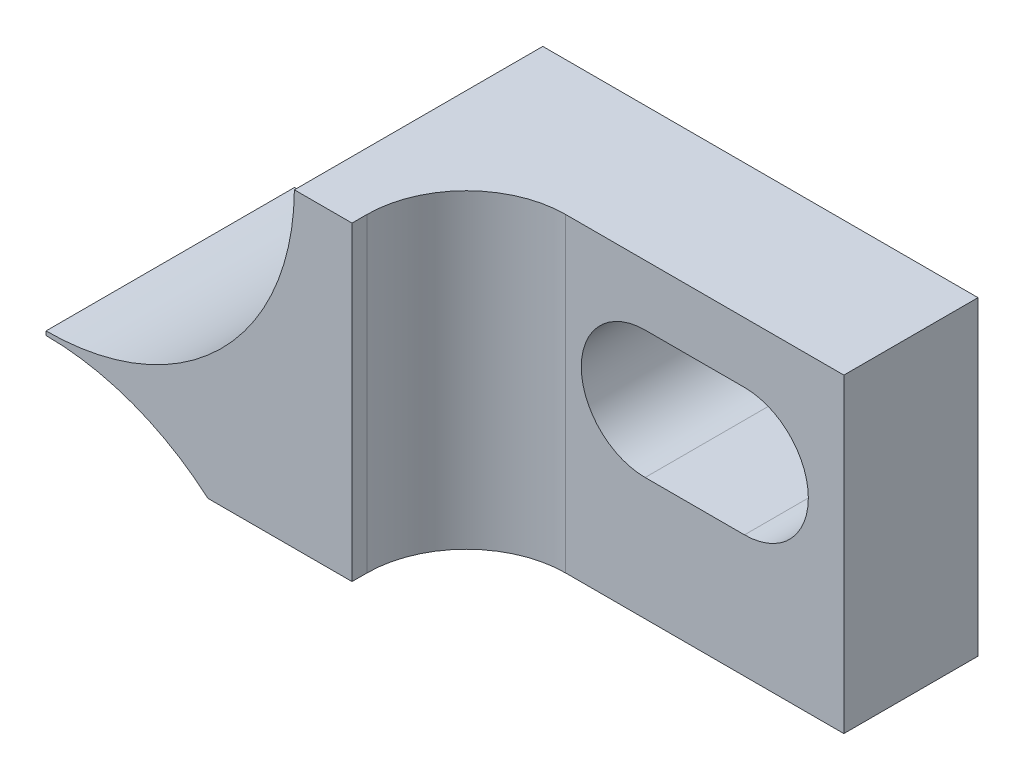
ISO-10303-21;
HEADER;
FILE_DESCRIPTION(('STEP AP214'),'2;1');
FILE_NAME('part.step','',(''),(''),'','','');
FILE_SCHEMA(('AUTOMOTIVE_DESIGN { 1 0 10303 214 1 1 1 1 }'));
ENDSEC;
DATA;
#1=APPLICATION_CONTEXT('core data for automotive mechanical design processes');
#2=APPLICATION_PROTOCOL_DEFINITION('international standard','automotive_design',2000,#1);
#3=PRODUCT_CONTEXT('',#1,'mechanical');
#4=PRODUCT('Part','Part','',(#3));
#5=PRODUCT_RELATED_PRODUCT_CATEGORY('part','',(#4));
#6=PRODUCT_DEFINITION_FORMATION('','',#4);
#7=PRODUCT_DEFINITION_CONTEXT('part definition',#1,'design');
#8=PRODUCT_DEFINITION('design','',#6,#7);
#9=PRODUCT_DEFINITION_SHAPE('','',#8);
#10=(LENGTH_UNIT() NAMED_UNIT(*) SI_UNIT(.MILLI.,.METRE.));
#11=(NAMED_UNIT(*) PLANE_ANGLE_UNIT() SI_UNIT($,.RADIAN.));
#12=(NAMED_UNIT(*) SI_UNIT($,.STERADIAN.) SOLID_ANGLE_UNIT());
#13=UNCERTAINTY_MEASURE_WITH_UNIT(LENGTH_MEASURE(1.E-05),#10,'distance_accuracy_value','');
#14=(GEOMETRIC_REPRESENTATION_CONTEXT(3) GLOBAL_UNCERTAINTY_ASSIGNED_CONTEXT((#13)) GLOBAL_UNIT_ASSIGNED_CONTEXT((#10,
#11,#12)) REPRESENTATION_CONTEXT('',''));
#15=CARTESIAN_POINT('',(0.,0.,0.));
#16=DIRECTION('',(0.,0.,1.));
#17=DIRECTION('',(1.,0.,0.));
#18=AXIS2_PLACEMENT_3D('',#15,#16,#17);
#19=CARTESIAN_POINT('',(96.8248,-0.0508000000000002,6.35));
#20=DIRECTION('',(0.,0.,-1.));
#21=DIRECTION('',(-1.,0.,0.));
#22=AXIS2_PLACEMENT_3D('',#19,#20,#21);
#23=CYLINDRICAL_SURFACE('',#22,6.35);
#24=DIRECTION('',(0.,0.,-1.));
#25=VECTOR('',#24,1.);
#26=CARTESIAN_POINT('',(96.8248,6.2992,6.35));
#27=LINE('',#26,#25);
#28=CARTESIAN_POINT('',(96.8248,6.2992,0.));
#29=VERTEX_POINT('',#28);
#30=CARTESIAN_POINT('',(96.8248,6.2992,6.35));
#31=VERTEX_POINT('',#30);
#32=EDGE_CURVE('E126',#29,#31,#27,.F.);
#33=ORIENTED_EDGE('',*,*,#32,.F.);
#34=CARTESIAN_POINT('',(96.8248,-0.0508000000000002,0.));
#35=DIRECTION('',(0.,0.,-1.));
#36=DIRECTION('',(-1.,0.,0.));
#37=AXIS2_PLACEMENT_3D('',#34,#35,#36);
#38=CIRCLE('',#37,6.35);
#39=CARTESIAN_POINT('',(100.966616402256,4.7625,0.));
#40=VERTEX_POINT('',#39);
#41=EDGE_CURVE('E137',#29,#40,#38,.T.);
#42=ORIENTED_EDGE('',*,*,#41,.T.);
#43=DIRECTION('',(0.,0.,-1.));
#44=VECTOR('',#43,1.);
#45=CARTESIAN_POINT('',(100.966616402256,4.7625,6.35));
#46=LINE('',#45,#44);
#47=CARTESIAN_POINT('',(100.966616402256,4.7625,6.35));
#48=VERTEX_POINT('',#47);
#49=EDGE_CURVE('E146',#40,#48,#46,.F.);
#50=ORIENTED_EDGE('',*,*,#49,.T.);
#51=CARTESIAN_POINT('',(96.8248,-0.0508000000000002,6.35));
#52=DIRECTION('',(0.,0.,-1.));
#53=DIRECTION('',(-1.,0.,0.));
#54=AXIS2_PLACEMENT_3D('',#51,#52,#53);
#55=CIRCLE('',#54,6.35);
#56=EDGE_CURVE('E139',#31,#48,#55,.T.);
#57=ORIENTED_EDGE('',*,*,#56,.F.);
#58=EDGE_LOOP('',(#33,#42,#50,#57));
#59=FACE_BOUND('',#58,.T.);
#60=ADVANCED_FACE('F32',(#59),#23,.F.);
#61=CARTESIAN_POINT('',(96.8248,12.7508,6.35));
#62=DIRECTION('',(0.,0.,-1.));
#63=DIRECTION('',(-1.,0.,0.));
#64=AXIS2_PLACEMENT_3D('',#61,#62,#63);
#65=CYLINDRICAL_SURFACE('',#64,6.35);
#66=DIRECTION('',(0.,0.,-1.));
#67=VECTOR('',#66,1.);
#68=CARTESIAN_POINT('',(96.8248,6.4008,6.35));
#69=LINE('',#68,#67);
#70=CARTESIAN_POINT('',(96.8248,6.4008,6.35));
#71=VERTEX_POINT('',#70);
#72=CARTESIAN_POINT('',(96.8248,6.4008,0.));
#73=VERTEX_POINT('',#72);
#74=EDGE_CURVE('E46',#71,#73,#69,.T.);
#75=ORIENTED_EDGE('',*,*,#74,.F.);
#76=CARTESIAN_POINT('',(96.8248,12.7508,6.35));
#77=DIRECTION('',(0.,0.,-1.));
#78=DIRECTION('',(-1.,0.,0.));
#79=AXIS2_PLACEMENT_3D('',#76,#77,#78);
#80=CIRCLE('',#79,6.35);
#81=CARTESIAN_POINT('',(103.174596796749,12.7,6.35));
#82=VERTEX_POINT('',#81);
#83=EDGE_CURVE('E154',#82,#71,#80,.T.);
#84=ORIENTED_EDGE('',*,*,#83,.F.);
#85=DIRECTION('',(0.,0.,-1.));
#86=VECTOR('',#85,1.);
#87=CARTESIAN_POINT('',(103.174596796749,12.7,6.35));
#88=LINE('',#87,#86);
#89=CARTESIAN_POINT('',(103.174596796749,12.7,0.));
#90=VERTEX_POINT('',#89);
#91=EDGE_CURVE('E181',#82,#90,#88,.T.);
#92=ORIENTED_EDGE('',*,*,#91,.T.);
#93=CARTESIAN_POINT('',(96.8248,12.7508,0.));
#94=DIRECTION('',(0.,0.,-1.));
#95=DIRECTION('',(-1.,0.,0.));
#96=AXIS2_PLACEMENT_3D('',#93,#94,#95);
#97=CIRCLE('',#96,6.35);
#98=EDGE_CURVE('E159',#90,#73,#97,.T.);
#99=ORIENTED_EDGE('',*,*,#98,.T.);
#100=EDGE_LOOP('',(#75,#84,#92,#99));
#101=FACE_BOUND('',#100,.T.);
#102=ADVANCED_FACE('F195',(#101),#65,.F.);
#103=CARTESIAN_POINT('',(-32.4430669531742,6.35000000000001,6.35));
#104=DIRECTION('',(0.,0.,-1.));
#105=DIRECTION('',(-1.,0.,0.));
#106=AXIS2_PLACEMENT_3D('',#103,#104,#105);
#107=PLANE('',#106);
#108=DIRECTION('',(0.,1.,0.));
#109=VECTOR('',#108,1.);
#110=CARTESIAN_POINT('',(96.8248,6.34999999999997,6.35));
#111=LINE('',#110,#109);
#112=EDGE_CURVE('E132',#31,#71,#111,.T.);
#113=ORIENTED_EDGE('',*,*,#112,.F.);
#114=ORIENTED_EDGE('',*,*,#56,.T.);
#115=DIRECTION('',(1.,0.,0.));
#116=VECTOR('',#115,1.);
#117=CARTESIAN_POINT('',(114.3,4.7625,6.35));
#118=LINE('',#117,#116);
#119=CARTESIAN_POINT('',(104.648,4.7625,6.35));
#120=VERTEX_POINT('',#119);
#121=EDGE_CURVE('E208',#48,#120,#118,.T.);
#122=ORIENTED_EDGE('',*,*,#121,.T.);
#123=DIRECTION('',(0.,-1.,0.));
#124=VECTOR('',#123,1.);
#125=CARTESIAN_POINT('',(104.648,12.7,6.35));
#126=LINE('',#125,#124);
#127=CARTESIAN_POINT('',(104.648,12.7,6.35));
#128=VERTEX_POINT('',#127);
#129=EDGE_CURVE('E221',#128,#120,#126,.T.);
#130=ORIENTED_EDGE('',*,*,#129,.F.);
#131=DIRECTION('',(1.,0.,0.));
#132=VECTOR('',#131,1.);
#133=CARTESIAN_POINT('',(-32.4430669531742,12.7,6.35));
#134=LINE('',#133,#132);
#135=EDGE_CURVE('E201',#82,#128,#134,.T.);
#136=ORIENTED_EDGE('',*,*,#135,.F.);
#137=ORIENTED_EDGE('',*,*,#83,.T.);
#138=EDGE_LOOP('',(#113,#114,#122,#130,#136,#137));
#139=FACE_BOUND('',#138,.T.);
#140=ADVANCED_FACE('F240',(#139),#107,.F.);
#141=CARTESIAN_POINT('',(-32.4430669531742,6.35000000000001,0.));
#142=DIRECTION('',(0.,0.,-1.));
#143=DIRECTION('',(-1.,0.,0.));
#144=AXIS2_PLACEMENT_3D('',#141,#142,#143);
#145=PLANE('',#144);
#146=DIRECTION('',(-1.,0.,0.));
#147=VECTOR('',#146,1.);
#148=CARTESIAN_POINT('',(-32.4430669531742,7.89304999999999,0.));
#149=LINE('',#148,#147);
#150=CARTESIAN_POINT('',(111.76,7.89304999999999,0.));
#151=VERTEX_POINT('',#150);
#152=CARTESIAN_POINT('',(109.22,7.89304999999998,0.));
#153=VERTEX_POINT('',#152);
#154=EDGE_CURVE('E161',#151,#153,#149,.T.);
#155=ORIENTED_EDGE('',*,*,#154,.F.);
#156=CARTESIAN_POINT('',(111.76,9.525,0.));
#157=DIRECTION('',(0.,0.,-1.));
#158=DIRECTION('',(-1.,0.,0.));
#159=AXIS2_PLACEMENT_3D('',#156,#157,#158);
#160=CIRCLE('',#159,1.63195);
#161=CARTESIAN_POINT('',(111.76,11.15695,0.));
#162=VERTEX_POINT('',#161);
#163=EDGE_CURVE('E170',#162,#151,#160,.T.);
#164=ORIENTED_EDGE('',*,*,#163,.F.);
#165=DIRECTION('',(1.,0.,0.));
#166=VECTOR('',#165,1.);
#167=CARTESIAN_POINT('',(-32.4430669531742,11.1569499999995,0.));
#168=LINE('',#167,#166);
#169=CARTESIAN_POINT('',(109.22,11.15695,0.));
#170=VERTEX_POINT('',#169);
#171=EDGE_CURVE('E167',#170,#162,#168,.T.);
#172=ORIENTED_EDGE('',*,*,#171,.F.);
#173=CARTESIAN_POINT('',(109.22,9.52499999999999,0.));
#174=DIRECTION('',(0.,0.,-1.));
#175=DIRECTION('',(-1.,0.,0.));
#176=AXIS2_PLACEMENT_3D('',#173,#174,#175);
#177=CIRCLE('',#176,1.63195);
#178=EDGE_CURVE('E164',#153,#170,#177,.T.);
#179=ORIENTED_EDGE('',*,*,#178,.F.);
#180=EDGE_LOOP('',(#155,#164,#172,#179));
#181=FACE_BOUND('',#180,.T.);
#182=ORIENTED_EDGE('',*,*,#41,.F.);
#183=DIRECTION('',(0.,1.,0.));
#184=VECTOR('',#183,1.);
#185=CARTESIAN_POINT('',(96.8248,19.9842856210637,0.));
#186=LINE('',#185,#184);
#187=EDGE_CURVE('E123',#29,#73,#186,.T.);
#188=ORIENTED_EDGE('',*,*,#187,.T.);
#189=ORIENTED_EDGE('',*,*,#98,.F.);
#190=DIRECTION('',(1.,0.,0.));
#191=VECTOR('',#190,1.);
#192=CARTESIAN_POINT('',(-32.4430669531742,12.7,0.));
#193=LINE('',#192,#191);
#194=CARTESIAN_POINT('',(114.3,12.7,0.));
#195=VERTEX_POINT('',#194);
#196=EDGE_CURVE('E149',#90,#195,#193,.T.);
#197=ORIENTED_EDGE('',*,*,#196,.T.);
#198=DIRECTION('',(0.,1.,0.));
#199=VECTOR('',#198,1.);
#200=CARTESIAN_POINT('',(114.3,6.35000000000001,0.));
#201=LINE('',#200,#199);
#202=CARTESIAN_POINT('',(114.3,4.7625,0.));
#203=VERTEX_POINT('',#202);
#204=EDGE_CURVE('E145',#203,#195,#201,.T.);
#205=ORIENTED_EDGE('',*,*,#204,.F.);
#206=DIRECTION('',(1.,0.,0.));
#207=VECTOR('',#206,1.);
#208=CARTESIAN_POINT('',(-32.4430669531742,4.7625,0.));
#209=LINE('',#208,#207);
#210=EDGE_CURVE('E11',#40,#203,#209,.T.);
#211=ORIENTED_EDGE('',*,*,#210,.F.);
#212=EDGE_LOOP('',(#182,#188,#189,#197,#205,#211));
#213=FACE_BOUND('',#212,.T.);
#214=ADVANCED_FACE('F143',(#181,#213),#145,.T.);
#215=CARTESIAN_POINT('',(-32.4430669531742,7.89304999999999,6.35));
#216=DIRECTION('',(0.,-1.,0.));
#217=DIRECTION('',(0.,0.,-1.));
#218=AXIS2_PLACEMENT_3D('',#215,#216,#217);
#219=PLANE('',#218);
#220=DIRECTION('',(0.,0.,-1.));
#221=VECTOR('',#220,1.);
#222=CARTESIAN_POINT('',(109.22,7.89304999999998,6.35));
#223=LINE('',#222,#221);
#224=CARTESIAN_POINT('',(109.22,7.89304999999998,3.429));
#225=VERTEX_POINT('',#224);
#226=EDGE_CURVE('E39',#225,#153,#223,.T.);
#227=ORIENTED_EDGE('',*,*,#226,.F.);
#228=DIRECTION('',(1.,0.,0.));
#229=VECTOR('',#228,1.);
#230=CARTESIAN_POINT('',(-32.4430669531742,7.89304999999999,3.42899999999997));
#231=LINE('',#230,#229);
#232=CARTESIAN_POINT('',(111.76,7.89304999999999,3.429));
#233=VERTEX_POINT('',#232);
#234=EDGE_CURVE('E211',#225,#233,#231,.T.);
#235=ORIENTED_EDGE('',*,*,#234,.T.);
#236=DIRECTION('',(0.,0.,-1.));
#237=VECTOR('',#236,1.);
#238=CARTESIAN_POINT('',(111.76,7.89304999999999,6.35));
#239=LINE('',#238,#237);
#240=EDGE_CURVE('E173',#233,#151,#239,.T.);
#241=ORIENTED_EDGE('',*,*,#240,.T.);
#242=ORIENTED_EDGE('',*,*,#154,.T.);
#243=EDGE_LOOP('',(#227,#235,#241,#242));
#244=FACE_BOUND('',#243,.T.);
#245=ADVANCED_FACE('F272',(#244),#219,.F.);
#246=CARTESIAN_POINT('',(109.22,9.52499999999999,6.35));
#247=DIRECTION('',(0.,0.,-1.));
#248=DIRECTION('',(-1.,0.,0.));
#249=AXIS2_PLACEMENT_3D('',#246,#247,#248);
#250=CYLINDRICAL_SURFACE('',#249,1.63195);
#251=DIRECTION('',(0.,0.,-1.));
#252=VECTOR('',#251,1.);
#253=CARTESIAN_POINT('',(109.22,11.15695,6.35));
#254=LINE('',#253,#252);
#255=CARTESIAN_POINT('',(109.22,11.15695,3.429));
#256=VERTEX_POINT('',#255);
#257=EDGE_CURVE('E178',#256,#170,#254,.T.);
#258=ORIENTED_EDGE('',*,*,#257,.F.);
#259=CARTESIAN_POINT('',(109.22,9.52499999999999,3.429));
#260=DIRECTION('',(0.,0.,-1.));
#261=DIRECTION('',(-1.,0.,0.));
#262=AXIS2_PLACEMENT_3D('',#259,#260,#261);
#263=CIRCLE('',#262,1.63195);
#264=EDGE_CURVE('E214',#256,#225,#263,.F.);
#265=ORIENTED_EDGE('',*,*,#264,.T.);
#266=ORIENTED_EDGE('',*,*,#226,.T.);
#267=ORIENTED_EDGE('',*,*,#178,.T.);
#268=EDGE_LOOP('',(#258,#265,#266,#267));
#269=FACE_BOUND('',#268,.T.);
#270=ADVANCED_FACE('F262',(#269),#250,.F.);
#271=CARTESIAN_POINT('',(-32.4430669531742,11.1569499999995,6.35));
#272=DIRECTION('',(0.,1.,0.));
#273=DIRECTION('',(-1.,0.,0.));
#274=AXIS2_PLACEMENT_3D('',#271,#272,#273);
#275=PLANE('',#274);
#276=DIRECTION('',(0.,0.,-1.));
#277=VECTOR('',#276,1.);
#278=CARTESIAN_POINT('',(111.76,11.15695,6.35));
#279=LINE('',#278,#277);
#280=CARTESIAN_POINT('',(111.76,11.15695,3.429));
#281=VERTEX_POINT('',#280);
#282=EDGE_CURVE('E175',#281,#162,#279,.T.);
#283=ORIENTED_EDGE('',*,*,#282,.F.);
#284=DIRECTION('',(-1.,0.,0.));
#285=VECTOR('',#284,1.);
#286=CARTESIAN_POINT('',(-32.4430669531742,11.1569499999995,3.42899999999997));
#287=LINE('',#286,#285);
#288=EDGE_CURVE('E54',#281,#256,#287,.T.);
#289=ORIENTED_EDGE('',*,*,#288,.T.);
#290=ORIENTED_EDGE('',*,*,#257,.T.);
#291=ORIENTED_EDGE('',*,*,#171,.T.);
#292=EDGE_LOOP('',(#283,#289,#290,#291));
#293=FACE_BOUND('',#292,.T.);
#294=ADVANCED_FACE('F261',(#293),#275,.F.);
#295=CARTESIAN_POINT('',(114.3,6.35000000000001,6.35));
#296=DIRECTION('',(-1.,0.,0.));
#297=DIRECTION('',(0.,0.,1.));
#298=AXIS2_PLACEMENT_3D('',#295,#296,#297);
#299=PLANE('',#298);
#300=DIRECTION('',(0.,0.,-1.));
#301=VECTOR('',#300,1.);
#302=CARTESIAN_POINT('',(114.3,12.7,6.35));
#303=LINE('',#302,#301);
#304=CARTESIAN_POINT('',(114.3,12.7,3.429));
#305=VERTEX_POINT('',#304);
#306=EDGE_CURVE('E176',#305,#195,#303,.T.);
#307=ORIENTED_EDGE('',*,*,#306,.F.);
#308=DIRECTION('',(0.,-1.,0.));
#309=VECTOR('',#308,1.);
#310=CARTESIAN_POINT('',(114.3,12.7,3.429));
#311=LINE('',#310,#309);
#312=CARTESIAN_POINT('',(114.3,4.7625,3.429));
#313=VERTEX_POINT('',#312);
#314=EDGE_CURVE('E220',#305,#313,#311,.T.);
#315=ORIENTED_EDGE('',*,*,#314,.T.);
#316=DIRECTION('',(0.,0.,-1.));
#317=VECTOR('',#316,1.);
#318=CARTESIAN_POINT('',(114.3,4.7625,6.35));
#319=LINE('',#318,#317);
#320=EDGE_CURVE('E151',#313,#203,#319,.T.);
#321=ORIENTED_EDGE('',*,*,#320,.T.);
#322=ORIENTED_EDGE('',*,*,#204,.T.);
#323=EDGE_LOOP('',(#307,#315,#321,#322));
#324=FACE_BOUND('',#323,.T.);
#325=ADVANCED_FACE('F192',(#324),#299,.F.);
#326=CARTESIAN_POINT('',(-32.4430669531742,12.7,6.35));
#327=DIRECTION('',(0.,1.,0.));
#328=DIRECTION('',(0.,0.,1.));
#329=AXIS2_PLACEMENT_3D('',#326,#327,#328);
#330=PLANE('',#329);
#331=DIRECTION('',(1.,0.,0.));
#332=VECTOR('',#331,1.);
#333=CARTESIAN_POINT('',(114.3,12.7,3.429));
#334=LINE('',#333,#332);
#335=CARTESIAN_POINT('',(107.188,12.7,3.429));
#336=VERTEX_POINT('',#335);
#337=EDGE_CURVE('E189',#336,#305,#334,.T.);
#338=ORIENTED_EDGE('',*,*,#337,.T.);
#339=ORIENTED_EDGE('',*,*,#306,.T.);
#340=ORIENTED_EDGE('',*,*,#196,.F.);
#341=ORIENTED_EDGE('',*,*,#91,.F.);
#342=ORIENTED_EDGE('',*,*,#135,.T.);
#343=DIRECTION('',(0.,0.,-1.));
#344=VECTOR('',#343,1.);
#345=CARTESIAN_POINT('',(104.648,12.7,6.35));
#346=LINE('',#345,#344);
#347=CARTESIAN_POINT('',(104.648,12.7,5.969));
#348=VERTEX_POINT('',#347);
#349=EDGE_CURVE('E202',#128,#348,#346,.T.);
#350=ORIENTED_EDGE('',*,*,#349,.T.);
#351=CARTESIAN_POINT('',(107.188,12.7,5.969));
#352=DIRECTION('',(0.,-1.,0.));
#353=DIRECTION('',(0.,0.,1.));
#354=AXIS2_PLACEMENT_3D('',#351,#352,#353);
#355=CIRCLE('',#354,2.54);
#356=EDGE_CURVE('E236',#348,#336,#355,.T.);
#357=ORIENTED_EDGE('',*,*,#356,.T.);
#358=EDGE_LOOP('',(#338,#339,#340,#341,#342,#350,#357));
#359=FACE_BOUND('',#358,.T.);
#360=ADVANCED_FACE('F186',(#359),#330,.T.);
#361=CARTESIAN_POINT('',(111.76,9.525,6.35));
#362=DIRECTION('',(0.,0.,-1.));
#363=DIRECTION('',(-1.,0.,0.));
#364=AXIS2_PLACEMENT_3D('',#361,#362,#363);
#365=CYLINDRICAL_SURFACE('',#364,1.63195);
#366=ORIENTED_EDGE('',*,*,#240,.F.);
#367=CARTESIAN_POINT('',(111.76,9.525,3.429));
#368=DIRECTION('',(0.,0.,-1.));
#369=DIRECTION('',(-1.,0.,0.));
#370=AXIS2_PLACEMENT_3D('',#367,#368,#369);
#371=CIRCLE('',#370,1.63195);
#372=EDGE_CURVE('E218',#233,#281,#371,.F.);
#373=ORIENTED_EDGE('',*,*,#372,.T.);
#374=ORIENTED_EDGE('',*,*,#282,.T.);
#375=ORIENTED_EDGE('',*,*,#163,.T.);
#376=EDGE_LOOP('',(#366,#373,#374,#375));
#377=FACE_BOUND('',#376,.T.);
#378=ADVANCED_FACE('F270',(#377),#365,.F.);
#379=CARTESIAN_POINT('',(114.3,4.7625,6.35));
#380=DIRECTION('',(0.,1.,0.));
#381=DIRECTION('',(0.,0.,1.));
#382=AXIS2_PLACEMENT_3D('',#379,#380,#381);
#383=PLANE('',#382);
#384=ORIENTED_EDGE('',*,*,#320,.F.);
#385=DIRECTION('',(1.,0.,0.));
#386=VECTOR('',#385,1.);
#387=CARTESIAN_POINT('',(114.3,4.7625,3.429));
#388=LINE('',#387,#386);
#389=CARTESIAN_POINT('',(107.188,4.7625,3.429));
#390=VERTEX_POINT('',#389);
#391=EDGE_CURVE('E228',#390,#313,#388,.T.);
#392=ORIENTED_EDGE('',*,*,#391,.F.);
#393=CARTESIAN_POINT('',(107.188,4.7625,5.969));
#394=DIRECTION('',(0.,-1.,0.));
#395=DIRECTION('',(0.,0.,1.));
#396=AXIS2_PLACEMENT_3D('',#393,#394,#395);
#397=CIRCLE('',#396,2.54);
#398=CARTESIAN_POINT('',(104.648,4.7625,5.969));
#399=VERTEX_POINT('',#398);
#400=EDGE_CURVE('E230',#399,#390,#397,.T.);
#401=ORIENTED_EDGE('',*,*,#400,.F.);
#402=DIRECTION('',(0.,0.,-1.));
#403=VECTOR('',#402,1.);
#404=CARTESIAN_POINT('',(104.648,4.7625,6.35));
#405=LINE('',#404,#403);
#406=EDGE_CURVE('E140',#120,#399,#405,.T.);
#407=ORIENTED_EDGE('',*,*,#406,.F.);
#408=ORIENTED_EDGE('',*,*,#121,.F.);
#409=ORIENTED_EDGE('',*,*,#49,.F.);
#410=ORIENTED_EDGE('',*,*,#210,.T.);
#411=EDGE_LOOP('',(#384,#392,#401,#407,#408,#409,#410));
#412=FACE_BOUND('',#411,.T.);
#413=ADVANCED_FACE('F244',(#412),#383,.F.);
#414=CARTESIAN_POINT('',(114.3,12.7,3.429));
#415=DIRECTION('',(0.,0.,-1.));
#416=DIRECTION('',(-1.,0.,0.));
#417=AXIS2_PLACEMENT_3D('',#414,#415,#416);
#418=PLANE('',#417);
#419=ORIENTED_EDGE('',*,*,#391,.T.);
#420=ORIENTED_EDGE('',*,*,#314,.F.);
#421=ORIENTED_EDGE('',*,*,#337,.F.);
#422=DIRECTION('',(0.,-1.,0.));
#423=VECTOR('',#422,1.);
#424=CARTESIAN_POINT('',(107.188,12.7,3.429));
#425=LINE('',#424,#423);
#426=EDGE_CURVE('E225',#336,#390,#425,.T.);
#427=ORIENTED_EDGE('',*,*,#426,.T.);
#428=EDGE_LOOP('',(#419,#420,#421,#427));
#429=FACE_BOUND('',#428,.T.);
#430=ORIENTED_EDGE('',*,*,#264,.F.);
#431=ORIENTED_EDGE('',*,*,#288,.F.);
#432=ORIENTED_EDGE('',*,*,#372,.F.);
#433=ORIENTED_EDGE('',*,*,#234,.F.);
#434=EDGE_LOOP('',(#430,#431,#432,#433));
#435=FACE_BOUND('',#434,.T.);
#436=ADVANCED_FACE('F253',(#429,#435),#418,.F.);
#437=CARTESIAN_POINT('',(107.188,12.7,5.969));
#438=DIRECTION('',(0.,-1.,0.));
#439=DIRECTION('',(0.,0.,-1.));
#440=AXIS2_PLACEMENT_3D('',#437,#438,#439);
#441=CYLINDRICAL_SURFACE('',#440,2.54);
#442=ORIENTED_EDGE('',*,*,#400,.T.);
#443=ORIENTED_EDGE('',*,*,#426,.F.);
#444=ORIENTED_EDGE('',*,*,#356,.F.);
#445=DIRECTION('',(0.,-1.,0.));
#446=VECTOR('',#445,1.);
#447=CARTESIAN_POINT('',(104.648,12.7,5.969));
#448=LINE('',#447,#446);
#449=EDGE_CURVE('E223',#348,#399,#448,.T.);
#450=ORIENTED_EDGE('',*,*,#449,.T.);
#451=EDGE_LOOP('',(#442,#443,#444,#450));
#452=FACE_BOUND('',#451,.T.);
#453=ADVANCED_FACE('F251',(#452),#441,.F.);
#454=CARTESIAN_POINT('',(104.648,12.7,6.35));
#455=DIRECTION('',(-1.,0.,0.));
#456=DIRECTION('',(0.,0.,1.));
#457=AXIS2_PLACEMENT_3D('',#454,#455,#456);
#458=PLANE('',#457);
#459=ORIENTED_EDGE('',*,*,#406,.T.);
#460=ORIENTED_EDGE('',*,*,#449,.F.);
#461=ORIENTED_EDGE('',*,*,#349,.F.);
#462=ORIENTED_EDGE('',*,*,#129,.T.);
#463=EDGE_LOOP('',(#459,#460,#461,#462));
#464=FACE_BOUND('',#463,.T.);
#465=ADVANCED_FACE('F248',(#464),#458,.F.);
#466=CARTESIAN_POINT('',(96.8248,19.9842856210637,8.89));
#467=DIRECTION('',(-1.,0.,0.));
#468=DIRECTION('',(0.,-1.,0.));
#469=AXIS2_PLACEMENT_3D('',#466,#467,#468);
#470=PLANE('',#469);
#471=ORIENTED_EDGE('',*,*,#32,.T.);
#472=ORIENTED_EDGE('',*,*,#112,.T.);
#473=ORIENTED_EDGE('',*,*,#74,.T.);
#474=ORIENTED_EDGE('',*,*,#187,.F.);
#475=EDGE_LOOP('',(#471,#472,#473,#474));
#476=FACE_BOUND('',#475,.T.);
#477=ADVANCED_FACE('F125',(#476),#470,.T.);
#478=CLOSED_SHELL('',(#60,#102,#140,#214,#245,#270,#294,#325,#360,#378,#413,#436,#453,#465,#477));
#479=MANIFOLD_SOLID_BREP('B2',#478);
#480=ADVANCED_BREP_SHAPE_REPRESENTATION('',(#18,#479),#14);
#481=SHAPE_DEFINITION_REPRESENTATION(#9,#480);
ENDSEC;
END-ISO-10303-21;
